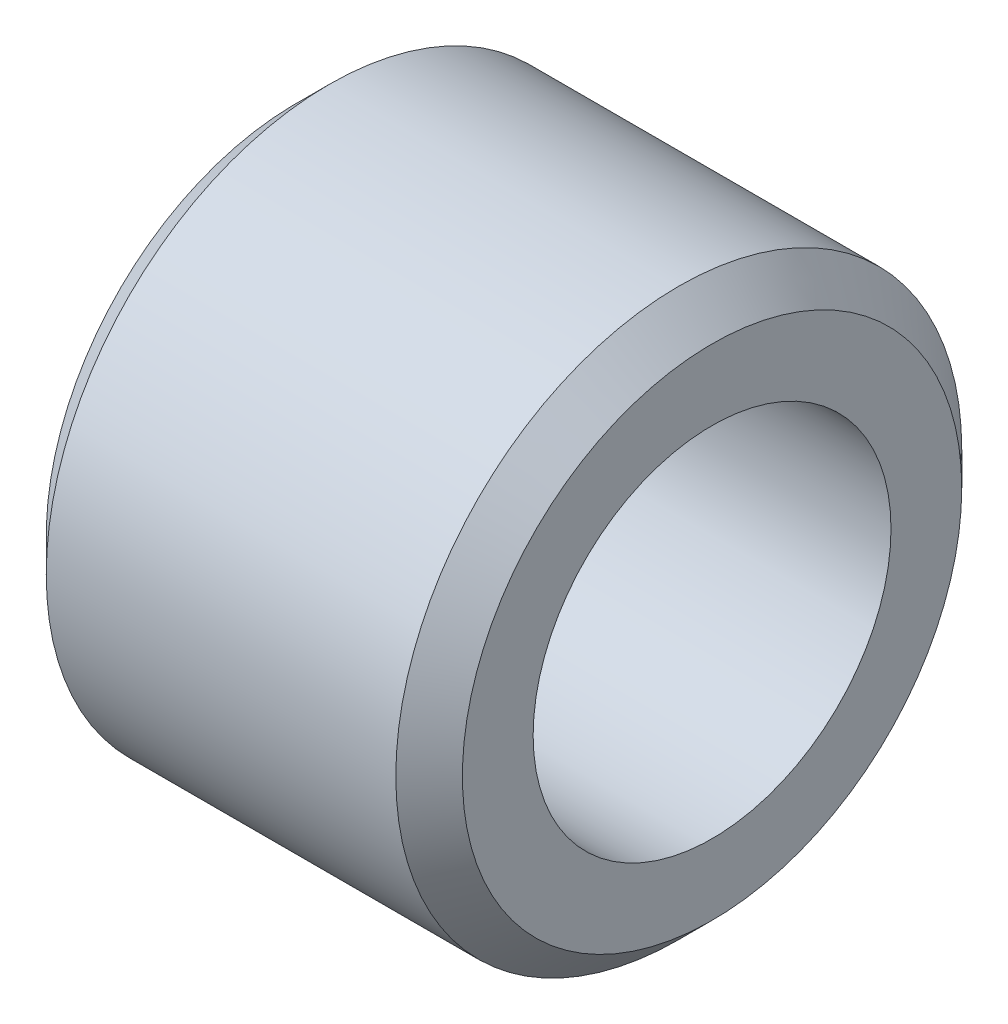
from build123d import *

# Parameters (mm, degrees)
SKETCH1_W     = 6.35
SKETCH1_H     = 1.5875
CHAMFER1_SIZE = 0.508


with BuildPart() as part:
    # Sweep1: sweep along a path in Sketch2
    with BuildLine(Plane(origin=(0, 0, 0), x_dir=(0, 0, -1), z_dir=(1, 0, 0))) as sweep1_path:
        CenterArc((-2.7305, 0), 2.7305, 0, 360)
    # Sketch1 → Sweep1 (sweep)
    with BuildSketch(Plane(origin=(0, 0, 0), x_dir=(1, 0, 0), z_dir=(0, 1, 0))):
        with Locations((3.175, 0.79375)):
            Rectangle(SKETCH1_W, SKETCH1_H)
    sweep(path=sweep1_path.line)

    # Chamfer1
    chamfer1_edges = [part.edges().sort_by_distance(p)[0] for p in [
        (6.35, 0, 7.0485),
        (0, 0, 7.0485),
    ]]
    chamfer(chamfer1_edges, length=CHAMFER1_SIZE)


solid = part.part
